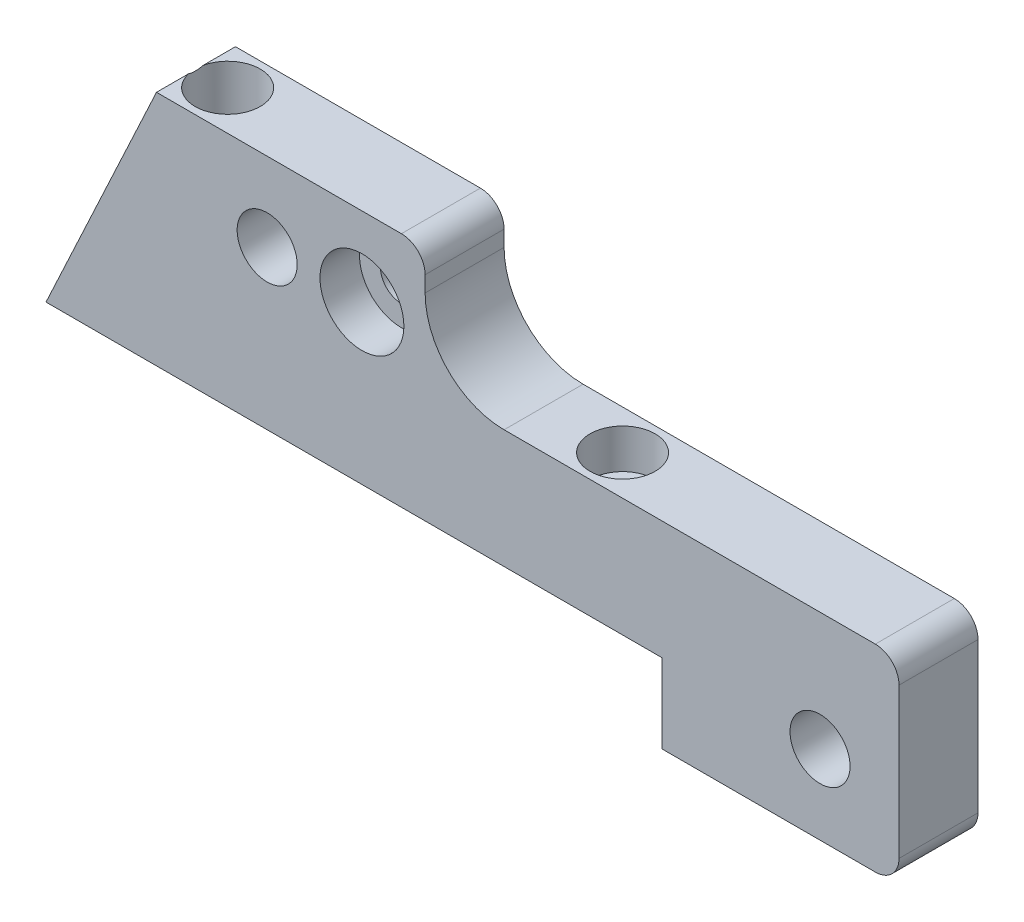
ISO-10303-21;
HEADER;
FILE_DESCRIPTION(('STEP AP214'),'2;1');
FILE_NAME('part.step','',(''),(''),'','','');
FILE_SCHEMA(('AUTOMOTIVE_DESIGN { 1 0 10303 214 1 1 1 1 }'));
ENDSEC;
DATA;
#1=APPLICATION_CONTEXT('core data for automotive mechanical design processes');
#2=APPLICATION_PROTOCOL_DEFINITION('international standard','automotive_design',2000,#1);
#3=PRODUCT_CONTEXT('',#1,'mechanical');
#4=PRODUCT('Part','Part','',(#3));
#5=PRODUCT_RELATED_PRODUCT_CATEGORY('part','',(#4));
#6=PRODUCT_DEFINITION_FORMATION('','',#4);
#7=PRODUCT_DEFINITION_CONTEXT('part definition',#1,'design');
#8=PRODUCT_DEFINITION('design','',#6,#7);
#9=PRODUCT_DEFINITION_SHAPE('','',#8);
#10=(LENGTH_UNIT() NAMED_UNIT(*) SI_UNIT(.MILLI.,.METRE.));
#11=(NAMED_UNIT(*) PLANE_ANGLE_UNIT() SI_UNIT($,.RADIAN.));
#12=(NAMED_UNIT(*) SI_UNIT($,.STERADIAN.) SOLID_ANGLE_UNIT());
#13=UNCERTAINTY_MEASURE_WITH_UNIT(LENGTH_MEASURE(1.E-05),#10,'distance_accuracy_value','');
#14=(GEOMETRIC_REPRESENTATION_CONTEXT(3) GLOBAL_UNCERTAINTY_ASSIGNED_CONTEXT((#13)) GLOBAL_UNIT_ASSIGNED_CONTEXT((#10,
#11,#12)) REPRESENTATION_CONTEXT('',''));
#15=CARTESIAN_POINT('',(0.,0.,0.));
#16=DIRECTION('',(0.,0.,1.));
#17=DIRECTION('',(1.,0.,0.));
#18=AXIS2_PLACEMENT_3D('',#15,#16,#17);
#19=CARTESIAN_POINT('',(-41.91,34.29,6.35));
#20=DIRECTION('',(0.,0.,-1.));
#21=DIRECTION('',(-1.,0.,0.));
#22=AXIS2_PLACEMENT_3D('',#19,#20,#21);
#23=PLANE('',#22);
#24=CARTESIAN_POINT('',(-48.26,25.4,6.35));
#25=DIRECTION('',(0.,0.,1.));
#26=DIRECTION('',(1.,0.,0.));
#27=AXIS2_PLACEMENT_3D('',#24,#25,#26);
#28=CIRCLE('',#27,6.74623999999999);
#29=CARTESIAN_POINT('',(-41.51376,25.4,6.35));
#30=VERTEX_POINT('',#29);
#31=EDGE_CURVE('E222',#30,#30,#28,.T.);
#32=ORIENTED_EDGE('',*,*,#31,.F.);
#33=EDGE_LOOP('',(#32));
#34=FACE_BOUND('',#33,.T.);
#35=DIRECTION('',(0.,-1.,0.));
#36=VECTOR('',#35,1.);
#37=CARTESIAN_POINT('',(0.,-12.7,6.35));
#38=LINE('',#37,#36);
#39=CARTESIAN_POINT('',(0.,0.,6.35));
#40=VERTEX_POINT('',#39);
#41=CARTESIAN_POINT('',(0.,-12.7,6.35));
#42=VERTEX_POINT('',#41);
#43=EDGE_CURVE('E190',#40,#42,#38,.T.);
#44=ORIENTED_EDGE('',*,*,#43,.T.);
#45=DIRECTION('',(1.,0.,0.));
#46=VECTOR('',#45,1.);
#47=CARTESIAN_POINT('',(34.29,-12.7,6.35));
#48=LINE('',#47,#46);
#49=CARTESIAN_POINT('',(34.29,-12.7,6.35));
#50=VERTEX_POINT('',#49);
#51=EDGE_CURVE('E111',#42,#50,#48,.T.);
#52=ORIENTED_EDGE('',*,*,#51,.T.);
#53=CARTESIAN_POINT('',(34.29,-8.89,6.35));
#54=DIRECTION('',(0.,0.,1.));
#55=DIRECTION('',(-1.,0.,0.));
#56=AXIS2_PLACEMENT_3D('',#53,#54,#55);
#57=CIRCLE('',#56,3.81);
#58=CARTESIAN_POINT('',(38.1,-8.89,6.35));
#59=VERTEX_POINT('',#58);
#60=EDGE_CURVE('E254',#50,#59,#57,.T.);
#61=ORIENTED_EDGE('',*,*,#60,.T.);
#62=DIRECTION('',(0.,1.,0.));
#63=VECTOR('',#62,1.);
#64=CARTESIAN_POINT('',(38.1,15.24,6.35));
#65=LINE('',#64,#63);
#66=CARTESIAN_POINT('',(38.1,15.24,6.35));
#67=VERTEX_POINT('',#66);
#68=EDGE_CURVE('E256',#59,#67,#65,.T.);
#69=ORIENTED_EDGE('',*,*,#68,.T.);
#70=CARTESIAN_POINT('',(34.29,15.24,6.35));
#71=DIRECTION('',(0.,0.,1.));
#72=DIRECTION('',(-1.,0.,0.));
#73=AXIS2_PLACEMENT_3D('',#70,#71,#72);
#74=CIRCLE('',#73,3.81);
#75=CARTESIAN_POINT('',(34.29,19.05,6.35));
#76=VERTEX_POINT('',#75);
#77=EDGE_CURVE('E258',#67,#76,#74,.T.);
#78=ORIENTED_EDGE('',*,*,#77,.T.);
#79=DIRECTION('',(-1.,0.,0.));
#80=VECTOR('',#79,1.);
#81=CARTESIAN_POINT('',(-25.4,19.05,6.35));
#82=LINE('',#81,#80);
#83=CARTESIAN_POINT('',(-25.4,19.05,6.35));
#84=VERTEX_POINT('',#83);
#85=EDGE_CURVE('E260',#76,#84,#82,.T.);
#86=ORIENTED_EDGE('',*,*,#85,.T.);
#87=CARTESIAN_POINT('',(-25.4,31.75,6.35));
#88=DIRECTION('',(0.,0.,-1.));
#89=DIRECTION('',(1.,0.,0.));
#90=AXIS2_PLACEMENT_3D('',#87,#88,#89);
#91=CIRCLE('',#90,12.7);
#92=CARTESIAN_POINT('',(-38.1,31.75,6.35));
#93=VERTEX_POINT('',#92);
#94=EDGE_CURVE('E262',#84,#93,#91,.T.);
#95=ORIENTED_EDGE('',*,*,#94,.T.);
#96=DIRECTION('',(0.,1.,0.));
#97=VECTOR('',#96,1.);
#98=CARTESIAN_POINT('',(-38.1,34.29,6.35));
#99=LINE('',#98,#97);
#100=CARTESIAN_POINT('',(-38.1,34.29,6.35));
#101=VERTEX_POINT('',#100);
#102=EDGE_CURVE('E264',#93,#101,#99,.T.);
#103=ORIENTED_EDGE('',*,*,#102,.T.);
#104=CARTESIAN_POINT('',(-41.91,34.29,6.35));
#105=DIRECTION('',(0.,0.,1.));
#106=DIRECTION('',(-1.,0.,0.));
#107=AXIS2_PLACEMENT_3D('',#104,#105,#106);
#108=CIRCLE('',#107,3.81);
#109=CARTESIAN_POINT('',(-41.91,38.1,6.35));
#110=VERTEX_POINT('',#109);
#111=EDGE_CURVE('E144',#101,#110,#108,.T.);
#112=ORIENTED_EDGE('',*,*,#111,.T.);
#113=DIRECTION('',(-1.,0.,0.));
#114=VECTOR('',#113,1.);
#115=CARTESIAN_POINT('',(-81.2936782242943,38.1,6.35));
#116=LINE('',#115,#114);
#117=CARTESIAN_POINT('',(-81.2936782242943,38.1,6.35));
#118=VERTEX_POINT('',#117);
#119=EDGE_CURVE('E137',#110,#118,#116,.T.);
#120=ORIENTED_EDGE('',*,*,#119,.T.);
#121=DIRECTION('',(-0.422618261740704,-0.906307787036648,0.));
#122=VECTOR('',#121,1.);
#123=CARTESIAN_POINT('',(-99.06,0.,6.35));
#124=LINE('',#123,#122);
#125=CARTESIAN_POINT('',(-99.06,0.,6.35));
#126=VERTEX_POINT('',#125);
#127=EDGE_CURVE('E141',#118,#126,#124,.T.);
#128=ORIENTED_EDGE('',*,*,#127,.T.);
#129=DIRECTION('',(1.,0.,0.));
#130=VECTOR('',#129,1.);
#131=CARTESIAN_POINT('',(0.,0.,6.35));
#132=LINE('',#131,#130);
#133=EDGE_CURVE('E57',#126,#40,#132,.T.);
#134=ORIENTED_EDGE('',*,*,#133,.T.);
#135=EDGE_LOOP('',(#44,#52,#61,#69,#78,#86,#95,#103,#112,#120,#128,#134));
#136=FACE_BOUND('',#135,.T.);
#137=CARTESIAN_POINT('',(-63.5,25.4,6.35));
#138=DIRECTION('',(0.,0.,1.));
#139=DIRECTION('',(1.,0.,0.));
#140=AXIS2_PLACEMENT_3D('',#137,#138,#139);
#141=CIRCLE('',#140,4.826);
#142=CARTESIAN_POINT('',(-58.674,25.4,6.35));
#143=VERTEX_POINT('',#142);
#144=EDGE_CURVE('E168',#143,#143,#141,.T.);
#145=ORIENTED_EDGE('',*,*,#144,.F.);
#146=EDGE_LOOP('',(#145));
#147=FACE_BOUND('',#146,.T.);
#148=CARTESIAN_POINT('',(25.4,0.,6.35));
#149=DIRECTION('',(0.,0.,1.));
#150=DIRECTION('',(1.,0.,0.));
#151=AXIS2_PLACEMENT_3D('',#148,#149,#150);
#152=CIRCLE('',#151,4.826);
#153=CARTESIAN_POINT('',(30.226,0.,6.35));
#154=VERTEX_POINT('',#153);
#155=EDGE_CURVE('E242',#154,#154,#152,.T.);
#156=ORIENTED_EDGE('',*,*,#155,.F.);
#157=EDGE_LOOP('',(#156));
#158=FACE_BOUND('',#157,.T.);
#159=ADVANCED_FACE('F33',(#34,#136,#147,#158),#23,.F.);
#160=CARTESIAN_POINT('',(-41.91,34.29,-6.35));
#161=DIRECTION('',(0.,0.,-1.));
#162=DIRECTION('',(-1.,0.,0.));
#163=AXIS2_PLACEMENT_3D('',#160,#161,#162);
#164=PLANE('',#163);
#165=CARTESIAN_POINT('',(-48.26,25.4,-6.35));
#166=DIRECTION('',(0.,0.,-1.));
#167=DIRECTION('',(-1.,0.,0.));
#168=AXIS2_PLACEMENT_3D('',#165,#166,#167);
#169=CIRCLE('',#168,3.3782);
#170=CARTESIAN_POINT('',(-51.6382,25.4,-6.35));
#171=VERTEX_POINT('',#170);
#172=EDGE_CURVE('E216',#171,#171,#169,.T.);
#173=ORIENTED_EDGE('',*,*,#172,.F.);
#174=EDGE_LOOP('',(#173));
#175=FACE_BOUND('',#174,.T.);
#176=CARTESIAN_POINT('',(-63.5,25.4,-6.35));
#177=DIRECTION('',(0.,0.,1.));
#178=DIRECTION('',(1.,0.,0.));
#179=AXIS2_PLACEMENT_3D('',#176,#177,#178);
#180=CIRCLE('',#179,4.826);
#181=CARTESIAN_POINT('',(-58.674,25.4,-6.35));
#182=VERTEX_POINT('',#181);
#183=EDGE_CURVE('E245',#182,#182,#180,.T.);
#184=ORIENTED_EDGE('',*,*,#183,.T.);
#185=EDGE_LOOP('',(#184));
#186=FACE_BOUND('',#185,.T.);
#187=DIRECTION('',(0.,-1.,0.));
#188=VECTOR('',#187,1.);
#189=CARTESIAN_POINT('',(0.,-12.7,-6.35));
#190=LINE('',#189,#188);
#191=CARTESIAN_POINT('',(0.,0.,-6.35));
#192=VERTEX_POINT('',#191);
#193=CARTESIAN_POINT('',(0.,-12.7,-6.35));
#194=VERTEX_POINT('',#193);
#195=EDGE_CURVE('E164',#192,#194,#190,.T.);
#196=ORIENTED_EDGE('',*,*,#195,.F.);
#197=DIRECTION('',(1.,0.,0.));
#198=VECTOR('',#197,1.);
#199=CARTESIAN_POINT('',(0.,0.,-6.35));
#200=LINE('',#199,#198);
#201=CARTESIAN_POINT('',(-99.06,0.,-6.35));
#202=VERTEX_POINT('',#201);
#203=EDGE_CURVE('E102',#202,#192,#200,.T.);
#204=ORIENTED_EDGE('',*,*,#203,.F.);
#205=DIRECTION('',(-0.422618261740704,-0.906307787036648,0.));
#206=VECTOR('',#205,1.);
#207=CARTESIAN_POINT('',(-99.06,0.,-6.35));
#208=LINE('',#207,#206);
#209=CARTESIAN_POINT('',(-81.2936782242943,38.1,-6.35));
#210=VERTEX_POINT('',#209);
#211=EDGE_CURVE('E187',#210,#202,#208,.T.);
#212=ORIENTED_EDGE('',*,*,#211,.F.);
#213=DIRECTION('',(-1.,0.,0.));
#214=VECTOR('',#213,1.);
#215=CARTESIAN_POINT('',(-81.2936782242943,38.1,-6.35));
#216=LINE('',#215,#214);
#217=CARTESIAN_POINT('',(-41.91,38.1,-6.35));
#218=VERTEX_POINT('',#217);
#219=EDGE_CURVE('E184',#218,#210,#216,.T.);
#220=ORIENTED_EDGE('',*,*,#219,.F.);
#221=CARTESIAN_POINT('',(-41.91,34.29,-6.35));
#222=DIRECTION('',(0.,0.,1.));
#223=DIRECTION('',(-1.,0.,0.));
#224=AXIS2_PLACEMENT_3D('',#221,#222,#223);
#225=CIRCLE('',#224,3.81);
#226=CARTESIAN_POINT('',(-38.1,34.29,-6.35));
#227=VERTEX_POINT('',#226);
#228=EDGE_CURVE('E182',#227,#218,#225,.T.);
#229=ORIENTED_EDGE('',*,*,#228,.F.);
#230=DIRECTION('',(0.,1.,0.));
#231=VECTOR('',#230,1.);
#232=CARTESIAN_POINT('',(-38.1,34.29,-6.35));
#233=LINE('',#232,#231);
#234=CARTESIAN_POINT('',(-38.1,31.75,-6.35));
#235=VERTEX_POINT('',#234);
#236=EDGE_CURVE('E180',#235,#227,#233,.T.);
#237=ORIENTED_EDGE('',*,*,#236,.F.);
#238=CARTESIAN_POINT('',(-25.4,31.75,-6.35));
#239=DIRECTION('',(0.,0.,-1.));
#240=DIRECTION('',(1.,0.,0.));
#241=AXIS2_PLACEMENT_3D('',#238,#239,#240);
#242=CIRCLE('',#241,12.7);
#243=CARTESIAN_POINT('',(-25.4,19.05,-6.35));
#244=VERTEX_POINT('',#243);
#245=EDGE_CURVE('E178',#244,#235,#242,.T.);
#246=ORIENTED_EDGE('',*,*,#245,.F.);
#247=DIRECTION('',(-1.,0.,0.));
#248=VECTOR('',#247,1.);
#249=CARTESIAN_POINT('',(-25.4,19.05,-6.35));
#250=LINE('',#249,#248);
#251=CARTESIAN_POINT('',(34.29,19.05,-6.35));
#252=VERTEX_POINT('',#251);
#253=EDGE_CURVE('E176',#252,#244,#250,.T.);
#254=ORIENTED_EDGE('',*,*,#253,.F.);
#255=CARTESIAN_POINT('',(34.29,15.24,-6.35));
#256=DIRECTION('',(0.,0.,1.));
#257=DIRECTION('',(-1.,0.,0.));
#258=AXIS2_PLACEMENT_3D('',#255,#256,#257);
#259=CIRCLE('',#258,3.81);
#260=CARTESIAN_POINT('',(38.1,15.24,-6.35));
#261=VERTEX_POINT('',#260);
#262=EDGE_CURVE('E174',#261,#252,#259,.T.);
#263=ORIENTED_EDGE('',*,*,#262,.F.);
#264=DIRECTION('',(0.,1.,0.));
#265=VECTOR('',#264,1.);
#266=CARTESIAN_POINT('',(38.1,15.24,-6.35));
#267=LINE('',#266,#265);
#268=CARTESIAN_POINT('',(38.1,-8.89,-6.35));
#269=VERTEX_POINT('',#268);
#270=EDGE_CURVE('E172',#269,#261,#267,.T.);
#271=ORIENTED_EDGE('',*,*,#270,.F.);
#272=CARTESIAN_POINT('',(34.29,-8.89,-6.35));
#273=DIRECTION('',(0.,0.,1.));
#274=DIRECTION('',(-1.,0.,0.));
#275=AXIS2_PLACEMENT_3D('',#272,#273,#274);
#276=CIRCLE('',#275,3.81);
#277=CARTESIAN_POINT('',(34.29,-12.7,-6.35));
#278=VERTEX_POINT('',#277);
#279=EDGE_CURVE('E170',#278,#269,#276,.T.);
#280=ORIENTED_EDGE('',*,*,#279,.F.);
#281=DIRECTION('',(1.,0.,0.));
#282=VECTOR('',#281,1.);
#283=CARTESIAN_POINT('',(34.29,-12.7,-6.35));
#284=LINE('',#283,#282);
#285=EDGE_CURVE('E167',#194,#278,#284,.T.);
#286=ORIENTED_EDGE('',*,*,#285,.F.);
#287=EDGE_LOOP('',(#196,#204,#212,#220,#229,#237,#246,#254,#263,#271,#280,#286));
#288=FACE_BOUND('',#287,.T.);
#289=CARTESIAN_POINT('',(25.4,0.,-6.35));
#290=DIRECTION('',(0.,0.,1.));
#291=DIRECTION('',(1.,0.,0.));
#292=AXIS2_PLACEMENT_3D('',#289,#290,#291);
#293=CIRCLE('',#292,4.826);
#294=CARTESIAN_POINT('',(30.226,0.,-6.35));
#295=VERTEX_POINT('',#294);
#296=EDGE_CURVE('E218',#295,#295,#293,.T.);
#297=ORIENTED_EDGE('',*,*,#296,.T.);
#298=EDGE_LOOP('',(#297));
#299=FACE_BOUND('',#298,.T.);
#300=ADVANCED_FACE('F279',(#175,#186,#288,#299),#164,.T.);
#301=CARTESIAN_POINT('',(0.,-12.7,6.35));
#302=DIRECTION('',(1.,0.,0.));
#303=DIRECTION('',(0.,0.,-1.));
#304=AXIS2_PLACEMENT_3D('',#301,#302,#303);
#305=PLANE('',#304);
#306=ORIENTED_EDGE('',*,*,#195,.T.);
#307=DIRECTION('',(0.,0.,-1.));
#308=VECTOR('',#307,1.);
#309=CARTESIAN_POINT('',(0.,-12.7,6.35));
#310=LINE('',#309,#308);
#311=EDGE_CURVE('E42',#42,#194,#310,.T.);
#312=ORIENTED_EDGE('',*,*,#311,.F.);
#313=ORIENTED_EDGE('',*,*,#43,.F.);
#314=DIRECTION('',(0.,0.,-1.));
#315=VECTOR('',#314,1.);
#316=CARTESIAN_POINT('',(0.,0.,6.35));
#317=LINE('',#316,#315);
#318=EDGE_CURVE('E160',#40,#192,#317,.T.);
#319=ORIENTED_EDGE('',*,*,#318,.T.);
#320=EDGE_LOOP('',(#306,#312,#313,#319));
#321=FACE_BOUND('',#320,.T.);
#322=ADVANCED_FACE('F35',(#321),#305,.F.);
#323=CARTESIAN_POINT('',(34.29,-12.7,6.35));
#324=DIRECTION('',(0.,1.,0.));
#325=DIRECTION('',(-1.,0.,0.));
#326=AXIS2_PLACEMENT_3D('',#323,#324,#325);
#327=PLANE('',#326);
#328=ORIENTED_EDGE('',*,*,#285,.T.);
#329=DIRECTION('',(0.,0.,-1.));
#330=VECTOR('',#329,1.);
#331=CARTESIAN_POINT('',(34.29,-12.7,6.35));
#332=LINE('',#331,#330);
#333=EDGE_CURVE('E212',#50,#278,#332,.T.);
#334=ORIENTED_EDGE('',*,*,#333,.F.);
#335=ORIENTED_EDGE('',*,*,#51,.F.);
#336=ORIENTED_EDGE('',*,*,#311,.T.);
#337=EDGE_LOOP('',(#328,#334,#335,#336));
#338=FACE_BOUND('',#337,.T.);
#339=ADVANCED_FACE('F287',(#338),#327,.F.);
#340=CARTESIAN_POINT('',(34.29,-8.89,6.35));
#341=DIRECTION('',(0.,0.,-1.));
#342=DIRECTION('',(-1.,0.,0.));
#343=AXIS2_PLACEMENT_3D('',#340,#341,#342);
#344=CYLINDRICAL_SURFACE('',#343,3.81);
#345=ORIENTED_EDGE('',*,*,#279,.T.);
#346=DIRECTION('',(0.,0.,-1.));
#347=VECTOR('',#346,1.);
#348=CARTESIAN_POINT('',(38.1,-8.89,6.35));
#349=LINE('',#348,#347);
#350=EDGE_CURVE('E209',#59,#269,#349,.T.);
#351=ORIENTED_EDGE('',*,*,#350,.F.);
#352=ORIENTED_EDGE('',*,*,#60,.F.);
#353=ORIENTED_EDGE('',*,*,#333,.T.);
#354=EDGE_LOOP('',(#345,#351,#352,#353));
#355=FACE_BOUND('',#354,.T.);
#356=ADVANCED_FACE('F290',(#355),#344,.T.);
#357=CARTESIAN_POINT('',(38.1,15.24,6.35));
#358=DIRECTION('',(-1.,0.,0.));
#359=DIRECTION('',(0.,-1.,0.));
#360=AXIS2_PLACEMENT_3D('',#357,#358,#359);
#361=PLANE('',#360);
#362=ORIENTED_EDGE('',*,*,#270,.T.);
#363=DIRECTION('',(0.,0.,-1.));
#364=VECTOR('',#363,1.);
#365=CARTESIAN_POINT('',(38.1,15.24,6.35));
#366=LINE('',#365,#364);
#367=EDGE_CURVE('E206',#67,#261,#366,.T.);
#368=ORIENTED_EDGE('',*,*,#367,.F.);
#369=ORIENTED_EDGE('',*,*,#68,.F.);
#370=ORIENTED_EDGE('',*,*,#350,.T.);
#371=EDGE_LOOP('',(#362,#368,#369,#370));
#372=FACE_BOUND('',#371,.T.);
#373=ADVANCED_FACE('F295',(#372),#361,.F.);
#374=CARTESIAN_POINT('',(34.29,15.24,6.35));
#375=DIRECTION('',(0.,0.,-1.));
#376=DIRECTION('',(-1.,0.,0.));
#377=AXIS2_PLACEMENT_3D('',#374,#375,#376);
#378=CYLINDRICAL_SURFACE('',#377,3.81);
#379=ORIENTED_EDGE('',*,*,#262,.T.);
#380=DIRECTION('',(0.,0.,-1.));
#381=VECTOR('',#380,1.);
#382=CARTESIAN_POINT('',(34.29,19.05,6.35));
#383=LINE('',#382,#381);
#384=EDGE_CURVE('E203',#76,#252,#383,.T.);
#385=ORIENTED_EDGE('',*,*,#384,.F.);
#386=ORIENTED_EDGE('',*,*,#77,.F.);
#387=ORIENTED_EDGE('',*,*,#367,.T.);
#388=EDGE_LOOP('',(#379,#385,#386,#387));
#389=FACE_BOUND('',#388,.T.);
#390=ADVANCED_FACE('F301',(#389),#378,.T.);
#391=CARTESIAN_POINT('',(-25.4,19.05,6.35));
#392=DIRECTION('',(0.,-1.,0.));
#393=DIRECTION('',(1.,0.,0.));
#394=AXIS2_PLACEMENT_3D('',#391,#392,#393);
#395=PLANE('',#394);
#396=CARTESIAN_POINT('',(-12.7,19.05,0.));
#397=DIRECTION('',(0.,1.,0.));
#398=DIRECTION('',(0.,0.,1.));
#399=AXIS2_PLACEMENT_3D('',#396,#397,#398);
#400=CIRCLE('',#399,5.23239999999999);
#401=CARTESIAN_POINT('',(-12.7,19.05,5.23239999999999));
#402=VERTEX_POINT('',#401);
#403=EDGE_CURVE('E539',#402,#402,#400,.T.);
#404=ORIENTED_EDGE('',*,*,#403,.F.);
#405=EDGE_LOOP('',(#404));
#406=FACE_BOUND('',#405,.T.);
#407=ORIENTED_EDGE('',*,*,#253,.T.);
#408=DIRECTION('',(0.,0.,-1.));
#409=VECTOR('',#408,1.);
#410=CARTESIAN_POINT('',(-25.4,19.05,6.35));
#411=LINE('',#410,#409);
#412=EDGE_CURVE('E200',#84,#244,#411,.T.);
#413=ORIENTED_EDGE('',*,*,#412,.F.);
#414=ORIENTED_EDGE('',*,*,#85,.F.);
#415=ORIENTED_EDGE('',*,*,#384,.T.);
#416=EDGE_LOOP('',(#407,#413,#414,#415));
#417=FACE_BOUND('',#416,.T.);
#418=ADVANCED_FACE('F305',(#406,#417),#395,.F.);
#419=CARTESIAN_POINT('',(-25.4,31.75,6.35));
#420=DIRECTION('',(0.,0.,-1.));
#421=DIRECTION('',(-1.,0.,0.));
#422=AXIS2_PLACEMENT_3D('',#419,#420,#421);
#423=CYLINDRICAL_SURFACE('',#422,12.7);
#424=ORIENTED_EDGE('',*,*,#245,.T.);
#425=DIRECTION('',(0.,0.,-1.));
#426=VECTOR('',#425,1.);
#427=CARTESIAN_POINT('',(-38.1,31.75,6.35));
#428=LINE('',#427,#426);
#429=EDGE_CURVE('E197',#93,#235,#428,.T.);
#430=ORIENTED_EDGE('',*,*,#429,.F.);
#431=ORIENTED_EDGE('',*,*,#94,.F.);
#432=ORIENTED_EDGE('',*,*,#412,.T.);
#433=EDGE_LOOP('',(#424,#430,#431,#432));
#434=FACE_BOUND('',#433,.T.);
#435=ADVANCED_FACE('F308',(#434),#423,.F.);
#436=CARTESIAN_POINT('',(-38.1,34.29,6.35));
#437=DIRECTION('',(-1.,0.,0.));
#438=DIRECTION('',(0.,-1.,0.));
#439=AXIS2_PLACEMENT_3D('',#436,#437,#438);
#440=PLANE('',#439);
#441=ORIENTED_EDGE('',*,*,#236,.T.);
#442=DIRECTION('',(0.,0.,-1.));
#443=VECTOR('',#442,1.);
#444=CARTESIAN_POINT('',(-38.1,34.29,6.35));
#445=LINE('',#444,#443);
#446=EDGE_CURVE('E194',#101,#227,#445,.T.);
#447=ORIENTED_EDGE('',*,*,#446,.F.);
#448=ORIENTED_EDGE('',*,*,#102,.F.);
#449=ORIENTED_EDGE('',*,*,#429,.T.);
#450=EDGE_LOOP('',(#441,#447,#448,#449));
#451=FACE_BOUND('',#450,.T.);
#452=ADVANCED_FACE('F270',(#451),#440,.F.);
#453=CARTESIAN_POINT('',(-41.91,34.29,6.35));
#454=DIRECTION('',(0.,0.,-1.));
#455=DIRECTION('',(-1.,0.,0.));
#456=AXIS2_PLACEMENT_3D('',#453,#454,#455);
#457=CYLINDRICAL_SURFACE('',#456,3.81);
#458=ORIENTED_EDGE('',*,*,#228,.T.);
#459=DIRECTION('',(0.,0.,-1.));
#460=VECTOR('',#459,1.);
#461=CARTESIAN_POINT('',(-41.91,38.1,6.35));
#462=LINE('',#461,#460);
#463=EDGE_CURVE('E154',#110,#218,#462,.T.);
#464=ORIENTED_EDGE('',*,*,#463,.F.);
#465=ORIENTED_EDGE('',*,*,#111,.F.);
#466=ORIENTED_EDGE('',*,*,#446,.T.);
#467=EDGE_LOOP('',(#458,#464,#465,#466));
#468=FACE_BOUND('',#467,.T.);
#469=ADVANCED_FACE('F274',(#468),#457,.T.);
#470=CARTESIAN_POINT('',(-81.2936782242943,38.1,6.35));
#471=DIRECTION('',(0.,-1.,0.));
#472=DIRECTION('',(0.,0.,-1.));
#473=AXIS2_PLACEMENT_3D('',#470,#471,#472);
#474=PLANE('',#473);
#475=DIRECTION('',(0.,0.,-1.));
#476=VECTOR('',#475,1.);
#477=CARTESIAN_POINT('',(-81.2936782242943,38.1,6.35));
#478=LINE('',#477,#476);
#479=CARTESIAN_POINT('',(-81.2936782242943,38.1,-1.19685082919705));
#480=VERTEX_POINT('',#479);
#481=EDGE_CURVE('E155',#480,#210,#478,.T.);
#482=ORIENTED_EDGE('',*,*,#481,.F.);
#483=CARTESIAN_POINT('',(-76.2,38.1,0.));
#484=DIRECTION('',(0.,1.,0.));
#485=DIRECTION('',(0.,0.,1.));
#486=AXIS2_PLACEMENT_3D('',#483,#484,#485);
#487=CIRCLE('',#486,5.2324);
#488=CARTESIAN_POINT('',(-81.2936782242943,38.1,1.19685082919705));
#489=VERTEX_POINT('',#488);
#490=EDGE_CURVE('E49',#489,#480,#487,.T.);
#491=ORIENTED_EDGE('',*,*,#490,.F.);
#492=EDGE_CURVE('E150',#118,#489,#478,.T.);
#493=ORIENTED_EDGE('',*,*,#492,.F.);
#494=ORIENTED_EDGE('',*,*,#119,.F.);
#495=ORIENTED_EDGE('',*,*,#463,.T.);
#496=ORIENTED_EDGE('',*,*,#219,.T.);
#497=EDGE_LOOP('',(#482,#491,#493,#494,#495,#496));
#498=FACE_BOUND('',#497,.T.);
#499=ADVANCED_FACE('F152',(#498),#474,.F.);
#500=CARTESIAN_POINT('',(-99.06,0.,6.35));
#501=DIRECTION('',(0.906307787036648,-0.422618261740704,0.));
#502=DIRECTION('',(0.422618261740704,0.906307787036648,0.));
#503=AXIS2_PLACEMENT_3D('',#500,#501,#502);
#504=PLANE('',#503);
#505=ORIENTED_EDGE('',*,*,#492,.T.);
#506=CARTESIAN_POINT('',(-76.2,49.0234282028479,0.));
#507=DIRECTION('',(0.906307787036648,-0.422618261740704,0.));
#508=DIRECTION('',(0.422618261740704,0.906307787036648,0.));
#509=AXIS2_PLACEMENT_3D('',#506,#507,#508);
#510=ELLIPSE('',#509,12.380913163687,5.2324);
#511=EDGE_CURVE('E11',#489,#480,#510,.T.);
#512=ORIENTED_EDGE('',*,*,#511,.T.);
#513=ORIENTED_EDGE('',*,*,#481,.T.);
#514=ORIENTED_EDGE('',*,*,#211,.T.);
#515=DIRECTION('',(0.,0.,-1.));
#516=VECTOR('',#515,1.);
#517=CARTESIAN_POINT('',(-99.06,0.,6.35));
#518=LINE('',#517,#516);
#519=EDGE_CURVE('E158',#126,#202,#518,.T.);
#520=ORIENTED_EDGE('',*,*,#519,.F.);
#521=ORIENTED_EDGE('',*,*,#127,.F.);
#522=EDGE_LOOP('',(#505,#512,#513,#514,#520,#521));
#523=FACE_BOUND('',#522,.T.);
#524=ADVANCED_FACE('F157',(#523),#504,.F.);
#525=CARTESIAN_POINT('',(0.,0.,6.35));
#526=DIRECTION('',(0.,1.,0.));
#527=DIRECTION('',(-1.,0.,0.));
#528=AXIS2_PLACEMENT_3D('',#525,#526,#527);
#529=PLANE('',#528);
#530=CARTESIAN_POINT('',(-12.7,0.,0.));
#531=DIRECTION('',(0.,1.,0.));
#532=DIRECTION('',(-1.,0.,0.));
#533=AXIS2_PLACEMENT_3D('',#530,#531,#532);
#534=CIRCLE('',#533,3.37819999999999);
#535=CARTESIAN_POINT('',(-16.0782,0.,0.));
#536=VERTEX_POINT('',#535);
#537=EDGE_CURVE('E37',#536,#536,#534,.T.);
#538=ORIENTED_EDGE('',*,*,#537,.T.);
#539=EDGE_LOOP('',(#538));
#540=FACE_BOUND('',#539,.T.);
#541=CARTESIAN_POINT('',(-76.2,0.,0.));
#542=DIRECTION('',(0.,1.,0.));
#543=DIRECTION('',(-1.,0.,0.));
#544=AXIS2_PLACEMENT_3D('',#541,#542,#543);
#545=CIRCLE('',#544,3.37819999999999);
#546=CARTESIAN_POINT('',(-79.5782,0.,0.));
#547=VERTEX_POINT('',#546);
#548=EDGE_CURVE('E220',#547,#547,#545,.T.);
#549=ORIENTED_EDGE('',*,*,#548,.T.);
#550=EDGE_LOOP('',(#549));
#551=FACE_BOUND('',#550,.T.);
#552=ORIENTED_EDGE('',*,*,#203,.T.);
#553=ORIENTED_EDGE('',*,*,#318,.F.);
#554=ORIENTED_EDGE('',*,*,#133,.F.);
#555=ORIENTED_EDGE('',*,*,#519,.T.);
#556=EDGE_LOOP('',(#552,#553,#554,#555));
#557=FACE_BOUND('',#556,.T.);
#558=ADVANCED_FACE('F281',(#540,#551,#557),#529,.F.);
#559=CARTESIAN_POINT('',(-63.5,25.4,6.35));
#560=DIRECTION('',(0.,0.,-1.));
#561=DIRECTION('',(-1.,0.,0.));
#562=AXIS2_PLACEMENT_3D('',#559,#560,#561);
#563=CYLINDRICAL_SURFACE('',#562,4.826);
#564=ORIENTED_EDGE('',*,*,#144,.T.);
#565=EDGE_LOOP('',(#564));
#566=FACE_BOUND('',#565,.T.);
#567=ORIENTED_EDGE('',*,*,#183,.F.);
#568=EDGE_LOOP('',(#567));
#569=FACE_BOUND('',#568,.T.);
#570=ADVANCED_FACE('F328',(#566,#569),#563,.F.);
#571=CARTESIAN_POINT('',(25.4,0.,6.35));
#572=DIRECTION('',(0.,0.,-1.));
#573=DIRECTION('',(-1.,0.,0.));
#574=AXIS2_PLACEMENT_3D('',#571,#572,#573);
#575=CYLINDRICAL_SURFACE('',#574,4.826);
#576=ORIENTED_EDGE('',*,*,#155,.T.);
#577=EDGE_LOOP('',(#576));
#578=FACE_BOUND('',#577,.T.);
#579=ORIENTED_EDGE('',*,*,#296,.F.);
#580=EDGE_LOOP('',(#579));
#581=FACE_BOUND('',#580,.T.);
#582=ADVANCED_FACE('F365',(#578,#581),#575,.F.);
#583=CARTESIAN_POINT('',(-48.26,25.4,6.35));
#584=DIRECTION('',(0.,0.,1.));
#585=DIRECTION('',(1.,0.,0.));
#586=AXIS2_PLACEMENT_3D('',#583,#584,#585);
#587=CYLINDRICAL_SURFACE('',#586,3.3782);
#588=ORIENTED_EDGE('',*,*,#172,.T.);
#589=EDGE_LOOP('',(#588));
#590=FACE_BOUND('',#589,.T.);
#591=CARTESIAN_POINT('',(-48.26,25.4,0.));
#592=DIRECTION('',(0.,0.,1.));
#593=DIRECTION('',(1.,0.,0.));
#594=AXIS2_PLACEMENT_3D('',#591,#592,#593);
#595=CIRCLE('',#594,3.3782);
#596=CARTESIAN_POINT('',(-44.8818,25.4,0.));
#597=VERTEX_POINT('',#596);
#598=EDGE_CURVE('E219',#597,#597,#595,.T.);
#599=ORIENTED_EDGE('',*,*,#598,.T.);
#600=EDGE_LOOP('',(#599));
#601=FACE_BOUND('',#600,.T.);
#602=ADVANCED_FACE('F372',(#590,#601),#587,.F.);
#603=CARTESIAN_POINT('',(-44.8818,25.4,0.));
#604=DIRECTION('',(0.,0.,-1.));
#605=DIRECTION('',(-1.,0.,0.));
#606=AXIS2_PLACEMENT_3D('',#603,#604,#605);
#607=PLANE('',#606);
#608=ORIENTED_EDGE('',*,*,#598,.F.);
#609=EDGE_LOOP('',(#608));
#610=FACE_BOUND('',#609,.T.);
#611=CARTESIAN_POINT('',(-48.26,25.4,0.));
#612=DIRECTION('',(0.,0.,1.));
#613=DIRECTION('',(1.,0.,0.));
#614=AXIS2_PLACEMENT_3D('',#611,#612,#613);
#615=CIRCLE('',#614,6.74623999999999);
#616=CARTESIAN_POINT('',(-41.51376,25.4,0.));
#617=VERTEX_POINT('',#616);
#618=EDGE_CURVE('E227',#617,#617,#615,.T.);
#619=ORIENTED_EDGE('',*,*,#618,.T.);
#620=EDGE_LOOP('',(#619));
#621=FACE_BOUND('',#620,.T.);
#622=ADVANCED_FACE('F379',(#610,#621),#607,.F.);
#623=CARTESIAN_POINT('',(-48.26,25.4,6.35));
#624=DIRECTION('',(0.,0.,1.));
#625=DIRECTION('',(1.,0.,0.));
#626=AXIS2_PLACEMENT_3D('',#623,#624,#625);
#627=CYLINDRICAL_SURFACE('',#626,6.74623999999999);
#628=ORIENTED_EDGE('',*,*,#618,.F.);
#629=EDGE_LOOP('',(#628));
#630=FACE_BOUND('',#629,.T.);
#631=ORIENTED_EDGE('',*,*,#31,.T.);
#632=EDGE_LOOP('',(#631));
#633=FACE_BOUND('',#632,.T.);
#634=ADVANCED_FACE('F388',(#630,#633),#627,.F.);
#635=CARTESIAN_POINT('',(-76.2,38.1,0.));
#636=DIRECTION('',(0.,1.,0.));
#637=DIRECTION('',(0.,0.,1.));
#638=AXIS2_PLACEMENT_3D('',#635,#636,#637);
#639=CYLINDRICAL_SURFACE('',#638,3.37819999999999);
#640=CARTESIAN_POINT('',(-76.2,19.05,0.));
#641=DIRECTION('',(0.,1.,0.));
#642=DIRECTION('',(0.,0.,1.));
#643=AXIS2_PLACEMENT_3D('',#640,#641,#642);
#644=CIRCLE('',#643,3.3782);
#645=CARTESIAN_POINT('',(-76.2,19.05,3.3782));
#646=VERTEX_POINT('',#645);
#647=EDGE_CURVE('E223',#646,#646,#644,.T.);
#648=ORIENTED_EDGE('',*,*,#647,.T.);
#649=EDGE_LOOP('',(#648));
#650=FACE_BOUND('',#649,.T.);
#651=ORIENTED_EDGE('',*,*,#548,.F.);
#652=EDGE_LOOP('',(#651));
#653=FACE_BOUND('',#652,.T.);
#654=ADVANCED_FACE('F395',(#650,#653),#639,.F.);
#655=CARTESIAN_POINT('',(-76.2,38.1,0.));
#656=DIRECTION('',(0.,1.,0.));
#657=DIRECTION('',(0.,0.,1.));
#658=AXIS2_PLACEMENT_3D('',#655,#656,#657);
#659=CYLINDRICAL_SURFACE('',#658,5.2324);
#660=CARTESIAN_POINT('',(-76.2,19.05,0.));
#661=DIRECTION('',(0.,1.,0.));
#662=DIRECTION('',(0.,0.,1.));
#663=AXIS2_PLACEMENT_3D('',#660,#661,#662);
#664=CIRCLE('',#663,5.2324);
#665=CARTESIAN_POINT('',(-76.2,19.05,5.2324));
#666=VERTEX_POINT('',#665);
#667=EDGE_CURVE('E230',#666,#666,#664,.T.);
#668=ORIENTED_EDGE('',*,*,#667,.F.);
#669=EDGE_LOOP('',(#668));
#670=FACE_BOUND('',#669,.T.);
#671=ORIENTED_EDGE('',*,*,#490,.T.);
#672=ORIENTED_EDGE('',*,*,#511,.F.);
#673=EDGE_LOOP('',(#671,#672));
#674=FACE_BOUND('',#673,.T.);
#675=ADVANCED_FACE('F402',(#670,#674),#659,.F.);
#676=CARTESIAN_POINT('',(-72.8218,19.05,0.));
#677=DIRECTION('',(0.,-1.,0.));
#678=DIRECTION('',(0.,0.,-1.));
#679=AXIS2_PLACEMENT_3D('',#676,#677,#678);
#680=PLANE('',#679);
#681=ORIENTED_EDGE('',*,*,#647,.F.);
#682=EDGE_LOOP('',(#681));
#683=FACE_BOUND('',#682,.T.);
#684=ORIENTED_EDGE('',*,*,#667,.T.);
#685=EDGE_LOOP('',(#684));
#686=FACE_BOUND('',#685,.T.);
#687=ADVANCED_FACE('F409',(#683,#686),#680,.F.);
#688=CARTESIAN_POINT('',(-12.7,19.05,0.));
#689=DIRECTION('',(0.,1.,0.));
#690=DIRECTION('',(0.,0.,1.));
#691=AXIS2_PLACEMENT_3D('',#688,#689,#690);
#692=CYLINDRICAL_SURFACE('',#691,3.37819999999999);
#693=CARTESIAN_POINT('',(-12.7,12.7,0.));
#694=DIRECTION('',(0.,1.,0.));
#695=DIRECTION('',(0.,0.,1.));
#696=AXIS2_PLACEMENT_3D('',#693,#694,#695);
#697=CIRCLE('',#696,3.3782);
#698=CARTESIAN_POINT('',(-12.7,12.7,3.3782));
#699=VERTEX_POINT('',#698);
#700=EDGE_CURVE('E541',#699,#699,#697,.T.);
#701=ORIENTED_EDGE('',*,*,#700,.T.);
#702=EDGE_LOOP('',(#701));
#703=FACE_BOUND('',#702,.T.);
#704=ORIENTED_EDGE('',*,*,#537,.F.);
#705=EDGE_LOOP('',(#704));
#706=FACE_BOUND('',#705,.T.);
#707=ADVANCED_FACE('F417',(#703,#706),#692,.F.);
#708=CARTESIAN_POINT('',(-9.32179999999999,12.7,0.));
#709=DIRECTION('',(0.,-1.,0.));
#710=DIRECTION('',(0.,0.,-1.));
#711=AXIS2_PLACEMENT_3D('',#708,#709,#710);
#712=PLANE('',#711);
#713=ORIENTED_EDGE('',*,*,#700,.F.);
#714=EDGE_LOOP('',(#713));
#715=FACE_BOUND('',#714,.T.);
#716=CARTESIAN_POINT('',(-12.7,12.7,0.));
#717=DIRECTION('',(0.,1.,0.));
#718=DIRECTION('',(0.,0.,1.));
#719=AXIS2_PLACEMENT_3D('',#716,#717,#718);
#720=CIRCLE('',#719,5.2324);
#721=CARTESIAN_POINT('',(-12.7,12.7,5.2324));
#722=VERTEX_POINT('',#721);
#723=EDGE_CURVE('E536',#722,#722,#720,.T.);
#724=ORIENTED_EDGE('',*,*,#723,.T.);
#725=EDGE_LOOP('',(#724));
#726=FACE_BOUND('',#725,.T.);
#727=ADVANCED_FACE('F424',(#715,#726),#712,.F.);
#728=CARTESIAN_POINT('',(-12.7,19.05,0.));
#729=DIRECTION('',(0.,1.,0.));
#730=DIRECTION('',(0.,0.,1.));
#731=AXIS2_PLACEMENT_3D('',#728,#729,#730);
#732=CYLINDRICAL_SURFACE('',#731,5.2324);
#733=ORIENTED_EDGE('',*,*,#723,.F.);
#734=EDGE_LOOP('',(#733));
#735=FACE_BOUND('',#734,.T.);
#736=ORIENTED_EDGE('',*,*,#403,.T.);
#737=EDGE_LOOP('',(#736));
#738=FACE_BOUND('',#737,.T.);
#739=ADVANCED_FACE('F432',(#735,#738),#732,.F.);
#740=CLOSED_SHELL('',(#159,#300,#322,#339,#356,#373,#390,#418,#435,#452,#469,#499,#524,#558,
#570,#582,#602,#622,#634,#654,#675,#687,#707,#727,#739));
#741=MANIFOLD_SOLID_BREP('B2',#740);
#742=ADVANCED_BREP_SHAPE_REPRESENTATION('',(#18,#741),#14);
#743=SHAPE_DEFINITION_REPRESENTATION(#9,#742);
ENDSEC;
END-ISO-10303-21;
